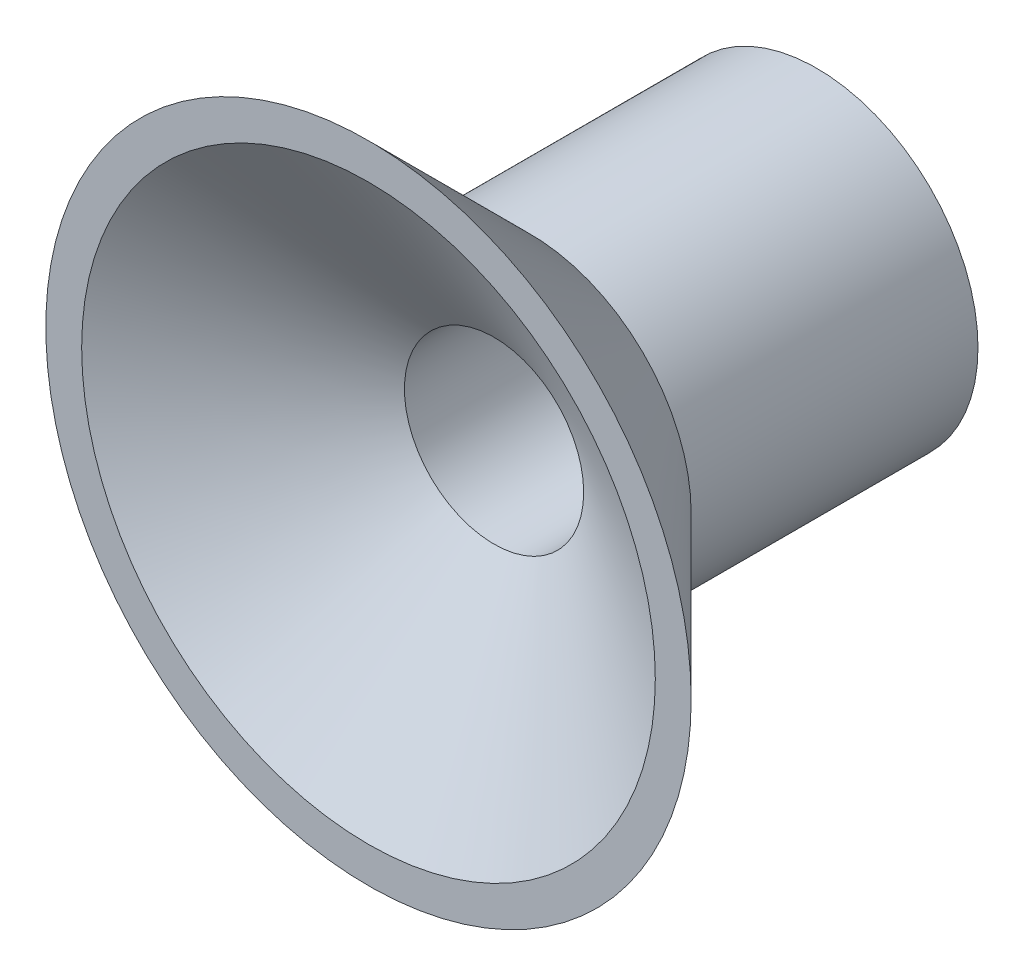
ISO-10303-21;
HEADER;
FILE_DESCRIPTION(('STEP AP214'),'2;1');
FILE_NAME('part.step','',(''),(''),'','','');
FILE_SCHEMA(('AUTOMOTIVE_DESIGN { 1 0 10303 214 1 1 1 1 }'));
ENDSEC;
DATA;
#1=APPLICATION_CONTEXT('core data for automotive mechanical design processes');
#2=APPLICATION_PROTOCOL_DEFINITION('international standard','automotive_design',2000,#1);
#3=PRODUCT_CONTEXT('',#1,'mechanical');
#4=PRODUCT('Part','Part','',(#3));
#5=PRODUCT_RELATED_PRODUCT_CATEGORY('part','',(#4));
#6=PRODUCT_DEFINITION_FORMATION('','',#4);
#7=PRODUCT_DEFINITION_CONTEXT('part definition',#1,'design');
#8=PRODUCT_DEFINITION('design','',#6,#7);
#9=PRODUCT_DEFINITION_SHAPE('','',#8);
#10=(LENGTH_UNIT() NAMED_UNIT(*) SI_UNIT(.MILLI.,.METRE.));
#11=(NAMED_UNIT(*) PLANE_ANGLE_UNIT() SI_UNIT($,.RADIAN.));
#12=(NAMED_UNIT(*) SI_UNIT($,.STERADIAN.) SOLID_ANGLE_UNIT());
#13=UNCERTAINTY_MEASURE_WITH_UNIT(LENGTH_MEASURE(1.E-05),#10,'distance_accuracy_value','');
#14=(GEOMETRIC_REPRESENTATION_CONTEXT(3) GLOBAL_UNCERTAINTY_ASSIGNED_CONTEXT((#13)) GLOBAL_UNIT_ASSIGNED_CONTEXT((#10,
#11,#12)) REPRESENTATION_CONTEXT('',''));
#15=CARTESIAN_POINT('',(0.,0.,0.));
#16=DIRECTION('',(0.,0.,1.));
#17=DIRECTION('',(1.,0.,0.));
#18=AXIS2_PLACEMENT_3D('',#15,#16,#17);
#19=CARTESIAN_POINT('',(0.,0.,-4.5));
#20=DIRECTION('',(0.,0.,1.));
#21=DIRECTION('',(1.,0.,0.));
#22=AXIS2_PLACEMENT_3D('',#19,#20,#21);
#23=CONICAL_SURFACE('',#22,4.5,0.785398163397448);
#24=CARTESIAN_POINT('',(0.,0.,0.));
#25=DIRECTION('',(0.,0.,1.));
#26=DIRECTION('',(1.,0.,0.));
#27=AXIS2_PLACEMENT_3D('',#24,#25,#26);
#28=CIRCLE('',#27,9.);
#29=CARTESIAN_POINT('',(9.,0.,0.));
#30=VERTEX_POINT('',#29);
#31=EDGE_CURVE('E55',#30,#30,#28,.T.);
#32=ORIENTED_EDGE('',*,*,#31,.F.);
#33=EDGE_LOOP('',(#32));
#34=FACE_BOUND('',#33,.T.);
#35=CARTESIAN_POINT('',(0.,0.,-4.5));
#36=DIRECTION('',(0.,0.,1.));
#37=DIRECTION('',(1.,0.,0.));
#38=AXIS2_PLACEMENT_3D('',#35,#36,#37);
#39=CIRCLE('',#38,4.5);
#40=CARTESIAN_POINT('',(4.5,0.,-4.5));
#41=VERTEX_POINT('',#40);
#42=EDGE_CURVE('E10',#41,#41,#39,.T.);
#43=ORIENTED_EDGE('',*,*,#42,.T.);
#44=EDGE_LOOP('',(#43));
#45=FACE_BOUND('',#44,.T.);
#46=ADVANCED_FACE('F33',(#34,#45),#23,.T.);
#47=CARTESIAN_POINT('',(0.,0.,0.));
#48=DIRECTION('',(0.,0.,1.));
#49=DIRECTION('',(1.,0.,0.));
#50=AXIS2_PLACEMENT_3D('',#47,#48,#49);
#51=CYLINDRICAL_SURFACE('',#50,4.5);
#52=ORIENTED_EDGE('',*,*,#42,.F.);
#53=EDGE_LOOP('',(#52));
#54=FACE_BOUND('',#53,.T.);
#55=CARTESIAN_POINT('',(0.,0.,-12.5));
#56=DIRECTION('',(0.,0.,1.));
#57=DIRECTION('',(1.,0.,0.));
#58=AXIS2_PLACEMENT_3D('',#55,#56,#57);
#59=CIRCLE('',#58,4.5);
#60=CARTESIAN_POINT('',(4.5,0.,-12.5));
#61=VERTEX_POINT('',#60);
#62=EDGE_CURVE('E39',#61,#61,#59,.T.);
#63=ORIENTED_EDGE('',*,*,#62,.T.);
#64=EDGE_LOOP('',(#63));
#65=FACE_BOUND('',#64,.T.);
#66=ADVANCED_FACE('F62',(#54,#65),#51,.T.);
#67=CARTESIAN_POINT('',(-2.5,0.,-12.5));
#68=DIRECTION('',(0.,0.,1.));
#69=DIRECTION('',(1.,0.,0.));
#70=AXIS2_PLACEMENT_3D('',#67,#68,#69);
#71=PLANE('',#70);
#72=ORIENTED_EDGE('',*,*,#62,.F.);
#73=EDGE_LOOP('',(#72));
#74=FACE_BOUND('',#73,.T.);
#75=CARTESIAN_POINT('',(0.,0.,-12.5));
#76=DIRECTION('',(0.,0.,1.));
#77=DIRECTION('',(1.,0.,0.));
#78=AXIS2_PLACEMENT_3D('',#75,#76,#77);
#79=CIRCLE('',#78,2.5);
#80=CARTESIAN_POINT('',(2.5,0.,-12.5));
#81=VERTEX_POINT('',#80);
#82=EDGE_CURVE('E43',#81,#81,#79,.T.);
#83=ORIENTED_EDGE('',*,*,#82,.T.);
#84=EDGE_LOOP('',(#83));
#85=FACE_BOUND('',#84,.T.);
#86=ADVANCED_FACE('F66',(#74,#85),#71,.F.);
#87=CARTESIAN_POINT('',(0.,0.,0.));
#88=DIRECTION('',(0.,0.,1.));
#89=DIRECTION('',(1.,0.,0.));
#90=AXIS2_PLACEMENT_3D('',#87,#88,#89);
#91=CYLINDRICAL_SURFACE('',#90,2.5);
#92=ORIENTED_EDGE('',*,*,#82,.F.);
#93=EDGE_LOOP('',(#92));
#94=FACE_BOUND('',#93,.T.);
#95=CARTESIAN_POINT('',(0.,0.,-3.50234733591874));
#96=DIRECTION('',(0.,0.,1.));
#97=DIRECTION('',(1.,0.,0.));
#98=AXIS2_PLACEMENT_3D('',#95,#96,#97);
#99=CIRCLE('',#98,2.5);
#100=CARTESIAN_POINT('',(2.5,0.,-3.50234733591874));
#101=VERTEX_POINT('',#100);
#102=EDGE_CURVE('E47',#101,#101,#99,.T.);
#103=ORIENTED_EDGE('',*,*,#102,.T.);
#104=EDGE_LOOP('',(#103));
#105=FACE_BOUND('',#104,.T.);
#106=ADVANCED_FACE('F71',(#94,#105),#91,.F.);
#107=CARTESIAN_POINT('',(0.,0.,0.));
#108=DIRECTION('',(0.,0.,1.));
#109=DIRECTION('',(1.,0.,0.));
#110=AXIS2_PLACEMENT_3D('',#107,#108,#109);
#111=CONICAL_SURFACE('',#110,8.00000000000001,1.00376339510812);
#112=CARTESIAN_POINT('',(0.,0.,0.));
#113=DIRECTION('',(0.,0.,1.));
#114=DIRECTION('',(1.,0.,0.));
#115=AXIS2_PLACEMENT_3D('',#112,#113,#114);
#116=CIRCLE('',#115,8.00000000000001);
#117=CARTESIAN_POINT('',(8.00000000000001,0.,0.));
#118=VERTEX_POINT('',#117);
#119=EDGE_CURVE('E52',#118,#118,#116,.T.);
#120=CARTESIAN_POINT('',(2.5,0.,-3.50234733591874));
#121=CARTESIAN_POINT('',(2.55729166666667,0.,-3.46586455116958));
#122=CARTESIAN_POINT('',(2.61458333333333,0.,-3.42938176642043));
#123=CARTESIAN_POINT('',(2.72916666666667,0.,-3.35641619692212));
#124=CARTESIAN_POINT('',(2.78645833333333,0.,-3.31993341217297));
#125=CARTESIAN_POINT('',(2.90104166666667,0.,-3.24696784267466));
#126=CARTESIAN_POINT('',(2.95833333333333,0.,-3.21048505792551));
#127=CARTESIAN_POINT('',(3.07291666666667,0.,-3.1375194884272));
#128=CARTESIAN_POINT('',(3.13020833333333,0.,-3.10103670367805));
#129=CARTESIAN_POINT('',(3.24479166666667,0.,-3.02807113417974));
#130=CARTESIAN_POINT('',(3.30208333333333,0.,-2.99158834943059));
#131=CARTESIAN_POINT('',(3.41666666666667,0.,-2.91862277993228));
#132=CARTESIAN_POINT('',(3.47395833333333,0.,-2.88213999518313));
#133=CARTESIAN_POINT('',(3.58854166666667,0.,-2.80917442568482));
#134=CARTESIAN_POINT('',(3.64583333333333,0.,-2.77269164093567));
#135=CARTESIAN_POINT('',(3.76041666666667,0.,-2.69972607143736));
#136=CARTESIAN_POINT('',(3.81770833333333,0.,-2.66324328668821));
#137=CARTESIAN_POINT('',(3.93229166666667,0.,-2.5902777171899));
#138=CARTESIAN_POINT('',(3.98958333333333,0.,-2.55379493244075));
#139=CARTESIAN_POINT('',(4.10416666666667,0.,-2.48082936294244));
#140=CARTESIAN_POINT('',(4.16145833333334,0.,-2.44434657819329));
#141=CARTESIAN_POINT('',(4.27604166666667,0.,-2.37138100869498));
#142=CARTESIAN_POINT('',(4.33333333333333,0.,-2.33489822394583));
#143=CARTESIAN_POINT('',(4.44791666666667,0.,-2.26193265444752));
#144=CARTESIAN_POINT('',(4.50520833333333,0.,-2.22544986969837));
#145=CARTESIAN_POINT('',(4.61979166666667,0.,-2.15248430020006));
#146=CARTESIAN_POINT('',(4.67708333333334,0.,-2.11600151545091));
#147=CARTESIAN_POINT('',(4.79166666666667,0.,-2.0430359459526));
#148=CARTESIAN_POINT('',(4.84895833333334,0.,-2.00655316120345));
#149=CARTESIAN_POINT('',(4.96354166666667,0.,-1.93358759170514));
#150=CARTESIAN_POINT('',(5.02083333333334,0.,-1.89710480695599));
#151=CARTESIAN_POINT('',(5.13541666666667,0.,-1.82413923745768));
#152=CARTESIAN_POINT('',(5.19270833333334,0.,-1.78765645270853));
#153=CARTESIAN_POINT('',(5.30729166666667,0.,-1.71469088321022));
#154=CARTESIAN_POINT('',(5.36458333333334,0.,-1.67820809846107));
#155=CARTESIAN_POINT('',(5.47916666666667,0.,-1.60524252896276));
#156=CARTESIAN_POINT('',(5.53645833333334,0.,-1.56875974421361));
#157=CARTESIAN_POINT('',(5.65104166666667,0.,-1.4957941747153));
#158=CARTESIAN_POINT('',(5.70833333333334,0.,-1.45931138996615));
#159=CARTESIAN_POINT('',(5.82291666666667,0.,-1.38634582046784));
#160=CARTESIAN_POINT('',(5.88020833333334,0.,-1.34986303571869));
#161=CARTESIAN_POINT('',(5.99479166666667,0.,-1.27689746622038));
#162=CARTESIAN_POINT('',(6.05208333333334,0.,-1.24041468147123));
#163=CARTESIAN_POINT('',(6.16666666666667,0.,-1.16744911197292));
#164=CARTESIAN_POINT('',(6.22395833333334,0.,-1.13096632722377));
#165=CARTESIAN_POINT('',(6.33854166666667,0.,-1.05800075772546));
#166=CARTESIAN_POINT('',(6.39583333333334,0.,-1.02151797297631));
#167=CARTESIAN_POINT('',(6.51041666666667,0.,-0.948552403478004));
#168=CARTESIAN_POINT('',(6.56770833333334,0.,-0.912069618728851));
#169=CARTESIAN_POINT('',(6.68229166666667,0.,-0.839104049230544));
#170=CARTESIAN_POINT('',(6.73958333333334,0.,-0.80262126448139));
#171=CARTESIAN_POINT('',(6.85416666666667,0.,-0.729655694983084));
#172=CARTESIAN_POINT('',(6.91145833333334,0.,-0.69317291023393));
#173=CARTESIAN_POINT('',(7.02604166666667,0.,-0.620207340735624));
#174=CARTESIAN_POINT('',(7.08333333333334,0.,-0.583724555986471));
#175=CARTESIAN_POINT('',(7.19791666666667,0.,-0.510758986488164));
#176=CARTESIAN_POINT('',(7.25520833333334,0.,-0.474276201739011));
#177=CARTESIAN_POINT('',(7.36979166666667,0.,-0.401310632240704));
#178=CARTESIAN_POINT('',(7.42708333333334,0.,-0.36482784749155));
#179=CARTESIAN_POINT('',(7.54166666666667,0.,-0.291862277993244));
#180=CARTESIAN_POINT('',(7.59895833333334,0.,-0.25537949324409));
#181=CARTESIAN_POINT('',(7.71354166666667,0.,-0.182413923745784));
#182=CARTESIAN_POINT('',(7.77083333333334,0.,-0.145931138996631));
#183=CARTESIAN_POINT('',(7.88541666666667,0.,-0.0729655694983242));
#184=CARTESIAN_POINT('',(7.94270833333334,0.,-0.0364827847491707));
#185=CARTESIAN_POINT('',(8.00000000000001,0.,0.));
#186=B_SPLINE_CURVE_WITH_KNOTS('',3,(#120,#121,#122,#123,#124,#125,#126,#127,#128,#129,#130,
#131,#132,#133,#134,#135,#136,#137,#138,#139,#140,#141,#142,#143,#144,#145,#146,#147,#148,#149,
#150,#151,#152,#153,#154,#155,#156,#157,#158,#159,#160,#161,#162,#163,#164,#165,#166,#167,#168,
#169,#170,#171,#172,#173,#174,#175,#176,#177,#178,#179,#180,#181,#182,#183,#184,#185),
.UNSPECIFIED.,.F.,.F.,(4,2,2,2,2,2,2,2,2,2,2,2,2,2,2,2,2,2,2,2,2,2,2,2,2,2,2,2,2,2,2,2,4),(0.,
0.203764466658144,0.407528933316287,0.611293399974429,0.815057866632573,1.01882233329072,
1.22258679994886,1.426351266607,1.63011573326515,1.83388019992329,2.03764466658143,
2.24140913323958,2.44517359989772,2.64893806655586,2.85270253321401,3.05646699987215,
3.26023146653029,3.46399593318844,3.66776039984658,3.87152486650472,4.07528933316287,
4.27905379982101,4.48281826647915,4.68658273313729,4.89034719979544,5.09411166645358,
5.29787613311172,5.50164059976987,5.70540506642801,5.90916953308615,6.1129339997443,
6.31669846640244,6.52046293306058),.UNSPECIFIED.);
#187=EDGE_CURVE('BSEAM77',#101,#118,#186,.T.);
#188=ORIENTED_EDGE('',*,*,#102,.F.);
#189=ORIENTED_EDGE('',*,*,#119,.T.);
#190=ORIENTED_EDGE('',*,*,#187,.T.);
#191=ORIENTED_EDGE('',*,*,#187,.F.);
#192=EDGE_LOOP('',(#188,#190,#189,#191));
#193=FACE_BOUND('',#192,.T.);
#194=ADVANCED_FACE('F77',(#193),#111,.F.);
#195=CARTESIAN_POINT('',(-8.00000000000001,0.,0.));
#196=DIRECTION('',(0.,0.,-1.));
#197=DIRECTION('',(-1.,0.,0.));
#198=AXIS2_PLACEMENT_3D('',#195,#196,#197);
#199=PLANE('',#198);
#200=ORIENTED_EDGE('',*,*,#119,.F.);
#201=EDGE_LOOP('',(#200));
#202=FACE_BOUND('',#201,.T.);
#203=ORIENTED_EDGE('',*,*,#31,.T.);
#204=EDGE_LOOP('',(#203));
#205=FACE_BOUND('',#204,.T.);
#206=ADVANCED_FACE('F59',(#202,#205),#199,.F.);
#207=CLOSED_SHELL('',(#46,#66,#86,#106,#194,#206));
#208=MANIFOLD_SOLID_BREP('B2',#207);
#209=ADVANCED_BREP_SHAPE_REPRESENTATION('',(#18,#208),#14);
#210=SHAPE_DEFINITION_REPRESENTATION(#9,#209);
ENDSEC;
END-ISO-10303-21;
